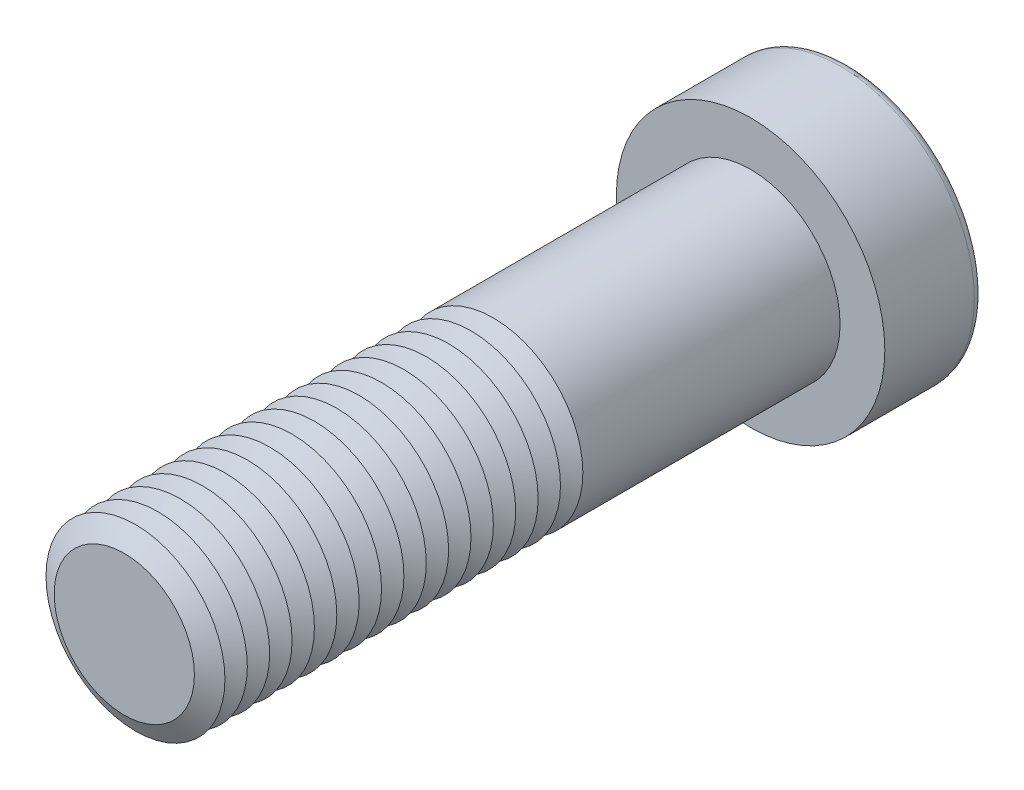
from build123d import *

# Parameters (mm, degrees)
SKETCH1_R           = 10
BOSS_EXTRUDE1_DEPTH = 70
SKETCH2_R           = 15
BOSS_EXTRUDE2_DEPTH = 11
CUT_EXTRUDE1_DEPTH  = 10.5
FILLET1_R           = 1
LPATTERN1_COUNT     = 17
LPATTERN1_PITCH     = 2.5


with BuildPart() as part:
    # Sketch1 → Boss-Extrude1 (new body)
    with BuildSketch(Plane.XY):
        Circle(SKETCH1_R)
    extrude(amount=BOSS_EXTRUDE1_DEPTH)

    # Sketch2 → Boss-Extrude2 (add)
    with BuildSketch(Plane(origin=(0, 0, 0), x_dir=(-1, 0, 0), z_dir=(0, 0, -1))):
        Circle(SKETCH2_R)
    extrude(amount=BOSS_EXTRUDE2_DEPTH)

    # Sketch3 → Cut-Extrude1 (cut)
    with BuildSketch(Plane(origin=(0, 0, -11), x_dir=(-1, 0, 0), z_dir=(0, 0, -1))):
        Polygon((-4.041451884, 7), (-8.082903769, 0), (-4.041451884, -7), (4.041451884, -7), (8.082903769, 0), (4.041451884, 7), align=None)
    extrude(amount=-CUT_EXTRUDE1_DEPTH, mode=Mode.SUBTRACT)

    # Fillet1
    fillet1_edges = [part.edges().sort_by_distance(p)[0] for p in [
        (15, 0, -11),
    ]]
    fillet(fillet1_edges, radius=FILLET1_R)

    # Cut-Extrude2 cone 1 section (on through the dimple's axis) → Cut-Extrude2 (revolve, cut)
    with BuildSketch(Plane(origin=(0, 0, -0.5), x_dir=(0, 1, 0), z_dir=(1, 0, 0))):
        Polygon((0, 0), (7, 0), (0, 4.041451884), align=None)
    revolve(axis=Axis((0, 0, -0.5), (0, 0, 1)), mode=Mode.SUBTRACT)

    # Cut-Extrude3 cone 1 section (on through the dimple's axis) → Cut-Extrude3 (revolve, cut)
    with BuildSketch(Plane(origin=(0, 0, -11), x_dir=(0, 1, 0), z_dir=(1, 0, 0))):
        Polygon((0, 0), (8.082903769, 0), (0, 2.165807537), align=None)
    revolve(axis=Axis((0, 0, -11), (0, 0, 1)), mode=Mode.SUBTRACT)

    # Sketch7 → Cut-Revolve1 (revolve, cut)
    with BuildSketch(Plane(origin=(0, 0, 0), x_dir=(0, 0, -1), z_dir=(1, 0, 0)), mode=Mode.PRIVATE) as cut_revolve1_sk:
        Polygon((-70, 7.834936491), (-68.75, 10), (-71.25, 10), align=None)
    cut_revolve1 = revolve(cut_revolve1_sk.sketch.rotate(Axis((0, 0, 70), (0, 0, -1)), 90), axis=Axis((0, 0, 70), (0, 0, -1)), mode=Mode.SUBTRACT)

    # LPattern1: Cut-Revolve1 ×17
    with Locations(*[(0, 0, -i * LPATTERN1_PITCH) for i in range(1, LPATTERN1_COUNT)]):
        add(cut_revolve1, mode=Mode.SUBTRACT)


solid = part.part
